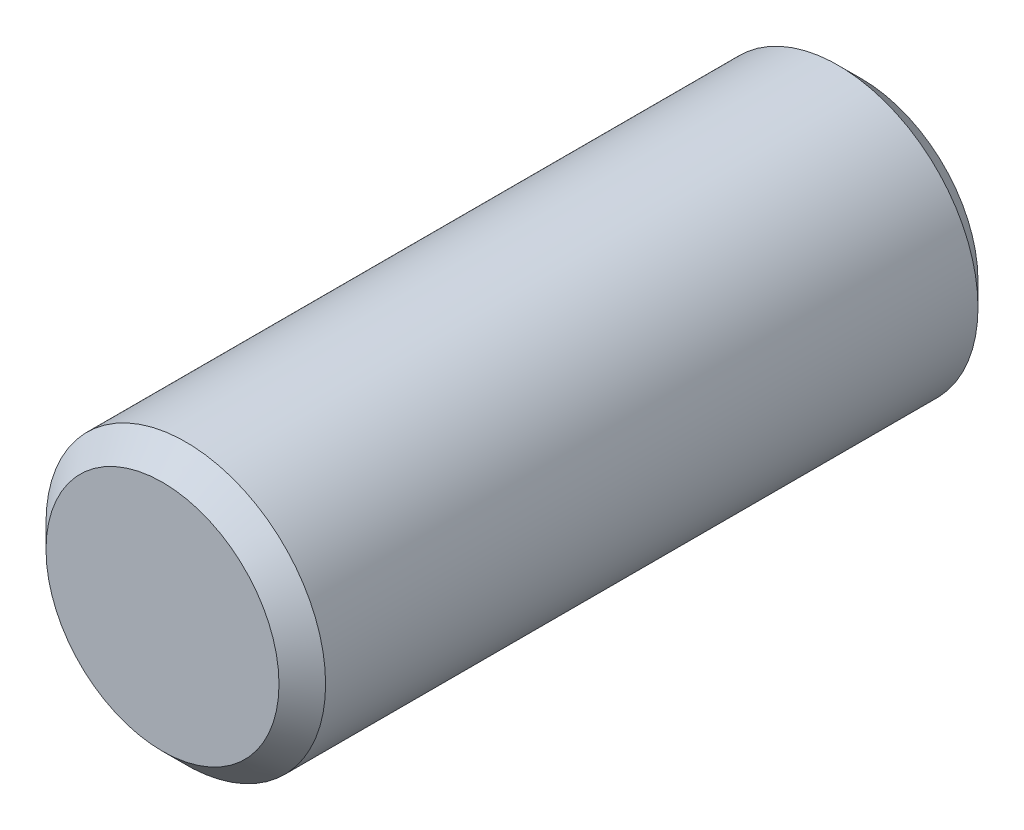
from build123d import *

# Parameters (mm, degrees)
ESQUISSE1_R        = 3
BOSS_EXTRU_1_DEPTH = 15
CHANFREIN1_SIZE    = 0.5


with BuildPart() as part:
    # Esquisse1 → Boss.-Extru.1 (new body)
    with BuildSketch(Plane.XY):
        Circle(ESQUISSE1_R)
    extrude(amount=BOSS_EXTRU_1_DEPTH)

    # Chanfrein1
    chanfrein1_edges = [part.edges().sort_by_distance(p)[0] for p in [
        (-3, 0, 0),
        (-3, 0, 15),
    ]]
    chamfer(chanfrein1_edges, length=CHANFREIN1_SIZE)


solid = part.part
